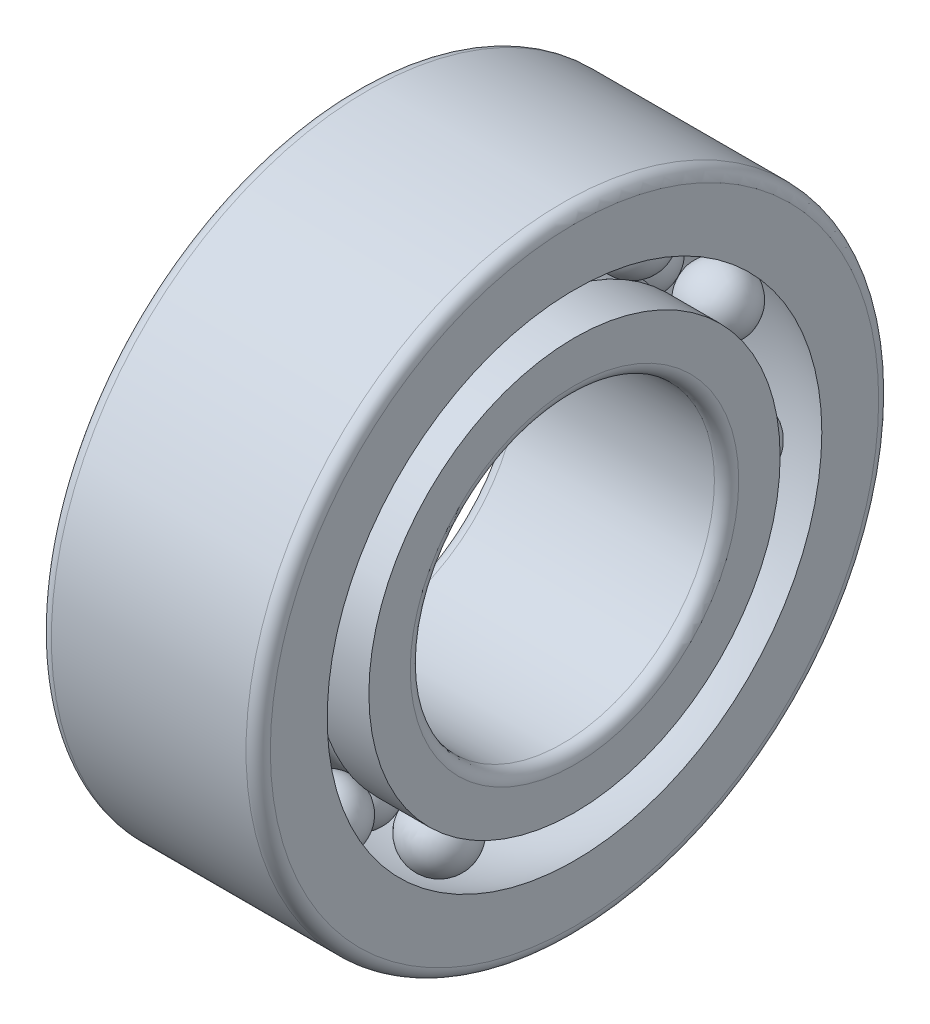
ISO-10303-21;
HEADER;
FILE_DESCRIPTION(('STEP AP214'),'2;1');
FILE_NAME('part.step','',(''),(''),'','','');
FILE_SCHEMA(('AUTOMOTIVE_DESIGN { 1 0 10303 214 1 1 1 1 }'));
ENDSEC;
DATA;
#1=APPLICATION_CONTEXT('core data for automotive mechanical design processes');
#2=APPLICATION_PROTOCOL_DEFINITION('international standard','automotive_design',2000,#1);
#3=PRODUCT_CONTEXT('',#1,'mechanical');
#4=PRODUCT('Part','Part','',(#3));
#5=PRODUCT_RELATED_PRODUCT_CATEGORY('part','',(#4));
#6=PRODUCT_DEFINITION_FORMATION('','',#4);
#7=PRODUCT_DEFINITION_CONTEXT('part definition',#1,'design');
#8=PRODUCT_DEFINITION('design','',#6,#7);
#9=PRODUCT_DEFINITION_SHAPE('','',#8);
#10=(LENGTH_UNIT() NAMED_UNIT(*) SI_UNIT(.MILLI.,.METRE.));
#11=(NAMED_UNIT(*) PLANE_ANGLE_UNIT() SI_UNIT($,.RADIAN.));
#12=(NAMED_UNIT(*) SI_UNIT($,.STERADIAN.) SOLID_ANGLE_UNIT());
#13=UNCERTAINTY_MEASURE_WITH_UNIT(LENGTH_MEASURE(1.E-05),#10,'distance_accuracy_value','');
#14=(GEOMETRIC_REPRESENTATION_CONTEXT(3) GLOBAL_UNCERTAINTY_ASSIGNED_CONTEXT((#13)) GLOBAL_UNIT_ASSIGNED_CONTEXT((#10,
#11,#12)) REPRESENTATION_CONTEXT('',''));
#15=CARTESIAN_POINT('',(0.,0.,0.));
#16=DIRECTION('',(0.,0.,1.));
#17=DIRECTION('',(1.,0.,0.));
#18=AXIS2_PLACEMENT_3D('',#15,#16,#17);
#19=CARTESIAN_POINT('',(5.7,-2.73956063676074,-19.054062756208));
#20=DIRECTION('',(1.,0.,0.));
#21=DIRECTION('',(0.,-0.989821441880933,0.142314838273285));
#22=AXIS2_PLACEMENT_3D('',#19,#20,#21);
#23=SPHERICAL_SURFACE('',#22,2.7);
#24=CARTESIAN_POINT('',(3.,-2.73956063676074,-19.054062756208));
#25=VERTEX_POINT('',#24);
#26=VERTEX_LOOP('',#25);
#27=FACE_BOUND('',#26,.T.);
#28=CARTESIAN_POINT('',(8.4,-2.73956063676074,-19.054062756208));
#29=VERTEX_POINT('',#28);
#30=VERTEX_LOOP('',#29);
#31=FACE_BOUND('',#30,.T.);
#32=ADVANCED_FACE('P0_F15',(#27,#31),#23,.T.);
#33=CLOSED_SHELL('',(#32));
#34=MANIFOLD_SOLID_BREP('P0_B1',#33);
#35=CARTESIAN_POINT('',(12.3,16.1941305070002,10.4073357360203));
#36=DIRECTION('',(1.,0.,0.));
#37=DIRECTION('',(0.,0.540640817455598,-0.841253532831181));
#38=AXIS2_PLACEMENT_3D('',#35,#36,#37);
#39=SPHERICAL_SURFACE('',#38,2.7);
#40=CARTESIAN_POINT('',(9.6,16.1941305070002,10.4073357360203));
#41=VERTEX_POINT('',#40);
#42=VERTEX_LOOP('',#41);
#43=FACE_BOUND('',#42,.T.);
#44=CARTESIAN_POINT('',(15.,16.1941305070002,10.4073357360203));
#45=VERTEX_POINT('',#44);
#46=VERTEX_LOOP('',#45);
#47=FACE_BOUND('',#46,.T.);
#48=ADVANCED_FACE('P1_F15',(#43,#47),#39,.T.);
#49=CLOSED_SHELL('',(#48));
#50=MANIFOLD_SOLID_BREP('P1_B1',#49);
#51=CARTESIAN_POINT('',(9.98438017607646,0.,0.));
#52=DIRECTION('',(1.,0.,0.));
#53=DIRECTION('',(0.,0.,-1.));
#54=AXIS2_PLACEMENT_3D('',#51,#52,#53);
#55=CYLINDRICAL_SURFACE('',#54,16.901);
#56=CARTESIAN_POINT('',(10.9687603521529,0.,0.));
#57=DIRECTION('',(1.,0.,0.));
#58=DIRECTION('',(0.,0.,-1.));
#59=AXIS2_PLACEMENT_3D('',#56,#57,#58);
#60=CIRCLE('',#59,16.901);
#61=CARTESIAN_POINT('',(10.9687603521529,0.,-16.901));
#62=VERTEX_POINT('',#61);
#63=EDGE_CURVE('P2_E123',#62,#62,#60,.T.);
#64=ORIENTED_EDGE('',*,*,#63,.F.);
#65=EDGE_LOOP('',(#64));
#66=FACE_BOUND('',#65,.T.);
#67=CARTESIAN_POINT('',(7.03123964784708,0.,0.));
#68=DIRECTION('',(-1.,0.,0.));
#69=DIRECTION('',(0.,0.,1.));
#70=AXIS2_PLACEMENT_3D('',#67,#68,#69);
#71=CIRCLE('',#70,16.901);
#72=CARTESIAN_POINT('',(7.03123964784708,0.,16.901));
#73=VERTEX_POINT('',#72);
#74=EDGE_CURVE('P2_E121',#73,#73,#71,.T.);
#75=ORIENTED_EDGE('',*,*,#74,.F.);
#76=EDGE_LOOP('',(#75));
#77=FACE_BOUND('',#76,.T.);
#78=ADVANCED_FACE('P2_F14',(#66,#77),#55,.T.);
#79=CARTESIAN_POINT('',(5.7,0.,0.));
#80=DIRECTION('',(1.,0.,0.));
#81=DIRECTION('',(0.,0.,-1.));
#82=AXIS2_PLACEMENT_3D('',#79,#80,#81);
#83=TOROIDAL_SURFACE('',#82,19.25,2.7);
#84=ORIENTED_EDGE('',*,*,#74,.T.);
#85=EDGE_LOOP('',(#84));
#86=FACE_BOUND('',#85,.T.);
#87=CARTESIAN_POINT('',(4.36876035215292,0.,0.));
#88=DIRECTION('',(1.,0.,0.));
#89=DIRECTION('',(0.,0.,-1.));
#90=AXIS2_PLACEMENT_3D('',#87,#88,#89);
#91=CIRCLE('',#90,16.901);
#92=CARTESIAN_POINT('',(4.36876035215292,0.,-16.901));
#93=VERTEX_POINT('',#92);
#94=EDGE_CURVE('P2_E126',#93,#93,#91,.F.);
#95=ORIENTED_EDGE('',*,*,#94,.F.);
#96=EDGE_LOOP('',(#95));
#97=FACE_BOUND('',#96,.T.);
#98=ADVANCED_FACE('P2_F90',(#86,#97),#83,.F.);
#99=CARTESIAN_POINT('',(12.3,0.,0.));
#100=DIRECTION('',(1.,0.,0.));
#101=DIRECTION('',(0.,1.,0.));
#102=AXIS2_PLACEMENT_3D('',#99,#100,#101);
#103=TOROIDAL_SURFACE('',#102,19.25,2.69999999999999);
#104=ORIENTED_EDGE('',*,*,#63,.T.);
#105=EDGE_LOOP('',(#104));
#106=FACE_BOUND('',#105,.T.);
#107=CARTESIAN_POINT('',(13.6312396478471,0.,0.));
#108=DIRECTION('',(1.,0.,0.));
#109=DIRECTION('',(0.,0.,-1.));
#110=AXIS2_PLACEMENT_3D('',#107,#108,#109);
#111=CIRCLE('',#110,16.901);
#112=CARTESIAN_POINT('',(13.6312396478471,0.,-16.901));
#113=VERTEX_POINT('',#112);
#114=EDGE_CURVE('P2_E119',#113,#113,#111,.T.);
#115=ORIENTED_EDGE('',*,*,#114,.F.);
#116=EDGE_LOOP('',(#115));
#117=FACE_BOUND('',#116,.T.);
#118=ADVANCED_FACE('P2_F16',(#106,#117),#103,.F.);
#119=CARTESIAN_POINT('',(2.18438017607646,0.,0.));
#120=DIRECTION('',(1.,0.,0.));
#121=DIRECTION('',(0.,0.,-1.));
#122=AXIS2_PLACEMENT_3D('',#119,#120,#121);
#123=CYLINDRICAL_SURFACE('',#122,16.901);
#124=CARTESIAN_POINT('',(0.,0.,0.));
#125=DIRECTION('',(1.,0.,0.));
#126=DIRECTION('',(0.,0.,-1.));
#127=AXIS2_PLACEMENT_3D('',#124,#125,#126);
#128=CIRCLE('',#127,16.901);
#129=CARTESIAN_POINT('',(0.,0.,-16.901));
#130=VERTEX_POINT('',#129);
#131=EDGE_CURVE('P2_E18',#130,#130,#128,.F.);
#132=ORIENTED_EDGE('',*,*,#131,.F.);
#133=EDGE_LOOP('',(#132));
#134=FACE_BOUND('',#133,.T.);
#135=ORIENTED_EDGE('',*,*,#94,.T.);
#136=EDGE_LOOP('',(#135));
#137=FACE_BOUND('',#136,.T.);
#138=ADVANCED_FACE('P2_F84',(#134,#137),#123,.T.);
#139=CARTESIAN_POINT('',(15.8156198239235,0.,0.));
#140=DIRECTION('',(1.,0.,0.));
#141=DIRECTION('',(0.,0.,-1.));
#142=AXIS2_PLACEMENT_3D('',#139,#140,#141);
#143=CYLINDRICAL_SURFACE('',#142,16.901);
#144=ORIENTED_EDGE('',*,*,#114,.T.);
#145=EDGE_LOOP('',(#144));
#146=FACE_BOUND('',#145,.T.);
#147=CARTESIAN_POINT('',(18.,0.,0.));
#148=DIRECTION('',(1.,0.,0.));
#149=DIRECTION('',(0.,0.,-1.));
#150=AXIS2_PLACEMENT_3D('',#147,#148,#149);
#151=CIRCLE('',#150,16.901);
#152=CARTESIAN_POINT('',(18.,0.,-16.901));
#153=VERTEX_POINT('',#152);
#154=EDGE_CURVE('P2_E114',#153,#153,#151,.T.);
#155=ORIENTED_EDGE('',*,*,#154,.F.);
#156=EDGE_LOOP('',(#155));
#157=FACE_BOUND('',#156,.T.);
#158=ADVANCED_FACE('P2_F80',(#146,#157),#143,.T.);
#159=CARTESIAN_POINT('',(0.,14.7005,0.));
#160=DIRECTION('',(-1.,0.,0.));
#161=DIRECTION('',(0.,0.,1.));
#162=AXIS2_PLACEMENT_3D('',#159,#160,#161);
#163=PLANE('',#162);
#164=CARTESIAN_POINT('',(0.,0.,0.));
#165=DIRECTION('',(-1.,0.,0.));
#166=DIRECTION('',(0.,1.,0.));
#167=AXIS2_PLACEMENT_3D('',#164,#165,#166);
#168=CIRCLE('',#167,13.5);
#169=CARTESIAN_POINT('',(0.,13.5,0.));
#170=VERTEX_POINT('',#169);
#171=EDGE_CURVE('P2_E64',#170,#170,#168,.T.);
#172=ORIENTED_EDGE('',*,*,#171,.F.);
#173=EDGE_LOOP('',(#172));
#174=FACE_BOUND('',#173,.T.);
#175=ORIENTED_EDGE('',*,*,#131,.T.);
#176=EDGE_LOOP('',(#175));
#177=FACE_BOUND('',#176,.T.);
#178=ADVANCED_FACE('P2_F70',(#174,#177),#163,.T.);
#179=CARTESIAN_POINT('',(18.,14.7005,0.));
#180=DIRECTION('',(1.,0.,0.));
#181=DIRECTION('',(0.,0.,-1.));
#182=AXIS2_PLACEMENT_3D('',#179,#180,#181);
#183=PLANE('',#182);
#184=CARTESIAN_POINT('',(18.,0.,0.));
#185=DIRECTION('',(1.,0.,0.));
#186=DIRECTION('',(0.,1.,0.));
#187=AXIS2_PLACEMENT_3D('',#184,#185,#186);
#188=CIRCLE('',#187,13.5);
#189=CARTESIAN_POINT('',(18.,13.5,0.));
#190=VERTEX_POINT('',#189);
#191=EDGE_CURVE('P2_E27',#190,#190,#188,.T.);
#192=ORIENTED_EDGE('',*,*,#191,.F.);
#193=EDGE_LOOP('',(#192));
#194=FACE_BOUND('',#193,.T.);
#195=ORIENTED_EDGE('',*,*,#154,.T.);
#196=EDGE_LOOP('',(#195));
#197=FACE_BOUND('',#196,.T.);
#198=ADVANCED_FACE('P2_F79',(#194,#197),#183,.T.);
#199=CARTESIAN_POINT('',(1.,0.,0.));
#200=DIRECTION('',(1.,0.,0.));
#201=DIRECTION('',(0.,0.,-1.));
#202=AXIS2_PLACEMENT_3D('',#199,#200,#201);
#203=TOROIDAL_SURFACE('',#202,13.5,1.);
#204=ORIENTED_EDGE('',*,*,#171,.T.);
#205=EDGE_LOOP('',(#204));
#206=FACE_BOUND('',#205,.T.);
#207=CARTESIAN_POINT('',(1.,0.,0.));
#208=DIRECTION('',(1.,0.,0.));
#209=DIRECTION('',(0.,0.,-1.));
#210=AXIS2_PLACEMENT_3D('',#207,#208,#209);
#211=CIRCLE('',#210,12.5);
#212=CARTESIAN_POINT('',(1.,0.,-12.5));
#213=VERTEX_POINT('',#212);
#214=EDGE_CURVE('P2_E22',#213,#213,#211,.T.);
#215=ORIENTED_EDGE('',*,*,#214,.T.);
#216=EDGE_LOOP('',(#215));
#217=FACE_BOUND('',#216,.T.);
#218=ADVANCED_FACE('P2_F45',(#206,#217),#203,.T.);
#219=CARTESIAN_POINT('',(17.,0.,0.));
#220=DIRECTION('',(1.,0.,0.));
#221=DIRECTION('',(0.,0.,-1.));
#222=AXIS2_PLACEMENT_3D('',#219,#220,#221);
#223=TOROIDAL_SURFACE('',#222,13.5,1.);
#224=CARTESIAN_POINT('',(17.,0.,0.));
#225=DIRECTION('',(1.,0.,0.));
#226=DIRECTION('',(0.,0.,-1.));
#227=AXIS2_PLACEMENT_3D('',#224,#225,#226);
#228=CIRCLE('',#227,12.5);
#229=CARTESIAN_POINT('',(17.,0.,-12.5));
#230=VERTEX_POINT('',#229);
#231=EDGE_CURVE('P2_E10',#230,#230,#228,.F.);
#232=ORIENTED_EDGE('',*,*,#231,.T.);
#233=EDGE_LOOP('',(#232));
#234=FACE_BOUND('',#233,.T.);
#235=ORIENTED_EDGE('',*,*,#191,.T.);
#236=EDGE_LOOP('',(#235));
#237=FACE_BOUND('',#236,.T.);
#238=ADVANCED_FACE('P2_F39',(#234,#237),#223,.T.);
#239=CARTESIAN_POINT('',(13.5,0.,0.));
#240=DIRECTION('',(1.,0.,0.));
#241=DIRECTION('',(0.,0.,-1.));
#242=AXIS2_PLACEMENT_3D('',#239,#240,#241);
#243=CYLINDRICAL_SURFACE('',#242,12.5);
#244=ORIENTED_EDGE('',*,*,#231,.F.);
#245=EDGE_LOOP('',(#244));
#246=FACE_BOUND('',#245,.T.);
#247=ORIENTED_EDGE('',*,*,#214,.F.);
#248=EDGE_LOOP('',(#247));
#249=FACE_BOUND('',#248,.T.);
#250=ADVANCED_FACE('P2_F44',(#246,#249),#243,.F.);
#251=CLOSED_SHELL('',(#78,#98,#118,#138,#158,#178,#198,#218,#238,#250));
#252=MANIFOLD_SOLID_BREP('P2_B1',#251);
#253=CARTESIAN_POINT('',(12.3,-2.73956063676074,19.054062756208));
#254=DIRECTION('',(1.,0.,0.));
#255=DIRECTION('',(0.,0.989821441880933,0.142314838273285));
#256=AXIS2_PLACEMENT_3D('',#253,#254,#255);
#257=SPHERICAL_SURFACE('',#256,2.7);
#258=CARTESIAN_POINT('',(9.6,-2.73956063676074,19.054062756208));
#259=VERTEX_POINT('',#258);
#260=VERTEX_LOOP('',#259);
#261=FACE_BOUND('',#260,.T.);
#262=CARTESIAN_POINT('',(15.,-2.73956063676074,19.054062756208));
#263=VERTEX_POINT('',#262);
#264=VERTEX_LOOP('',#263);
#265=FACE_BOUND('',#264,.T.);
#266=ADVANCED_FACE('P3_F15',(#261,#265),#257,.T.);
#267=CLOSED_SHELL('',(#266));
#268=MANIFOLD_SOLID_BREP('P3_B1',#267);
#269=CARTESIAN_POINT('',(9.,0.,0.));
#270=DIRECTION('',(0.,0.,1.));
#271=DIRECTION('',(1.,0.,0.));
#272=AXIS2_PLACEMENT_3D('',#269,#270,#271);
#273=SPHERICAL_SURFACE('',#272,22.2308089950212);
#274=CARTESIAN_POINT('',(9.,0.,0.));
#275=DIRECTION('',(1.,0.,0.));
#276=DIRECTION('',(0.,0.,-1.));
#277=AXIS2_PLACEMENT_3D('',#274,#275,#276);
#278=SPHERICAL_SURFACE('',#277,22.2308089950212);
#279=CARTESIAN_POINT('',(18.,0.,0.));
#280=DIRECTION('',(1.,0.,0.));
#281=DIRECTION('',(0.,0.,-1.));
#282=AXIS2_PLACEMENT_3D('',#279,#280,#281);
#283=CIRCLE('',#282,20.3275396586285);
#284=CARTESIAN_POINT('',(18.,0.,-20.3275396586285));
#285=VERTEX_POINT('',#284);
#286=EDGE_CURVE('P4_E91',#285,#285,#283,.F.);
#287=ORIENTED_EDGE('',*,*,#286,.F.);
#288=EDGE_LOOP('',(#287));
#289=FACE_BOUND('',#288,.T.);
#290=CARTESIAN_POINT('',(0.,0.,0.));
#291=DIRECTION('',(-1.,0.,0.));
#292=DIRECTION('',(0.,0.,1.));
#293=AXIS2_PLACEMENT_3D('',#290,#291,#292);
#294=CIRCLE('',#293,20.3275396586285);
#295=CARTESIAN_POINT('',(0.,0.,20.3275396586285));
#296=VERTEX_POINT('',#295);
#297=EDGE_CURVE('P4_E17',#296,#296,#294,.F.);
#298=ORIENTED_EDGE('',*,*,#297,.F.);
#299=EDGE_LOOP('',(#298));
#300=FACE_BOUND('',#299,.T.);
#301=ADVANCED_FACE('P4_F14',(#289,#300),#278,.F.);
#302=CARTESIAN_POINT('',(0.,23.1637698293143,0.));
#303=DIRECTION('',(-1.,0.,0.));
#304=DIRECTION('',(0.,0.,1.));
#305=AXIS2_PLACEMENT_3D('',#302,#303,#304);
#306=PLANE('',#305);
#307=ORIENTED_EDGE('',*,*,#297,.T.);
#308=EDGE_LOOP('',(#307));
#309=FACE_BOUND('',#308,.T.);
#310=CARTESIAN_POINT('',(0.,0.,0.));
#311=DIRECTION('',(1.,0.,0.));
#312=DIRECTION('',(0.,1.,0.));
#313=AXIS2_PLACEMENT_3D('',#310,#311,#312);
#314=CIRCLE('',#313,25.);
#315=CARTESIAN_POINT('',(0.,25.,0.));
#316=VERTEX_POINT('',#315);
#317=EDGE_CURVE('P4_E64',#316,#316,#314,.T.);
#318=ORIENTED_EDGE('',*,*,#317,.F.);
#319=EDGE_LOOP('',(#318));
#320=FACE_BOUND('',#319,.T.);
#321=ADVANCED_FACE('P4_F69',(#309,#320),#306,.T.);
#322=CARTESIAN_POINT('',(18.,23.1637698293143,0.));
#323=DIRECTION('',(1.,0.,0.));
#324=DIRECTION('',(0.,0.,-1.));
#325=AXIS2_PLACEMENT_3D('',#322,#323,#324);
#326=PLANE('',#325);
#327=ORIENTED_EDGE('',*,*,#286,.T.);
#328=EDGE_LOOP('',(#327));
#329=FACE_BOUND('',#328,.T.);
#330=CARTESIAN_POINT('',(18.,0.,0.));
#331=DIRECTION('',(-1.,0.,0.));
#332=DIRECTION('',(0.,1.,0.));
#333=AXIS2_PLACEMENT_3D('',#330,#331,#332);
#334=CIRCLE('',#333,25.);
#335=CARTESIAN_POINT('',(18.,25.,0.));
#336=VERTEX_POINT('',#335);
#337=EDGE_CURVE('P4_E26',#336,#336,#334,.T.);
#338=ORIENTED_EDGE('',*,*,#337,.F.);
#339=EDGE_LOOP('',(#338));
#340=FACE_BOUND('',#339,.T.);
#341=ADVANCED_FACE('P4_F77',(#329,#340),#326,.T.);
#342=CARTESIAN_POINT('',(0.999999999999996,0.,0.));
#343=DIRECTION('',(1.,0.,0.));
#344=DIRECTION('',(0.,0.,-1.));
#345=AXIS2_PLACEMENT_3D('',#342,#343,#344);
#346=TOROIDAL_SURFACE('',#345,25.,1.);
#347=CARTESIAN_POINT('',(0.999999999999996,0.,0.));
#348=DIRECTION('',(1.,0.,0.));
#349=DIRECTION('',(0.,0.,-1.));
#350=AXIS2_PLACEMENT_3D('',#347,#348,#349);
#351=CIRCLE('',#350,26.);
#352=CARTESIAN_POINT('',(0.999999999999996,0.,-26.));
#353=VERTEX_POINT('',#352);
#354=EDGE_CURVE('P4_E21',#353,#353,#351,.T.);
#355=ORIENTED_EDGE('',*,*,#354,.F.);
#356=EDGE_LOOP('',(#355));
#357=FACE_BOUND('',#356,.T.);
#358=ORIENTED_EDGE('',*,*,#317,.T.);
#359=EDGE_LOOP('',(#358));
#360=FACE_BOUND('',#359,.T.);
#361=ADVANCED_FACE('P4_F44',(#357,#360),#346,.T.);
#362=CARTESIAN_POINT('',(17.,0.,0.));
#363=DIRECTION('',(1.,0.,0.));
#364=DIRECTION('',(0.,0.,-1.));
#365=AXIS2_PLACEMENT_3D('',#362,#363,#364);
#366=TOROIDAL_SURFACE('',#365,25.,1.);
#367=ORIENTED_EDGE('',*,*,#337,.T.);
#368=EDGE_LOOP('',(#367));
#369=FACE_BOUND('',#368,.T.);
#370=CARTESIAN_POINT('',(17.,0.,0.));
#371=DIRECTION('',(1.,0.,0.));
#372=DIRECTION('',(0.,0.,-1.));
#373=AXIS2_PLACEMENT_3D('',#370,#371,#372);
#374=CIRCLE('',#373,26.);
#375=CARTESIAN_POINT('',(17.,0.,-26.));
#376=VERTEX_POINT('',#375);
#377=EDGE_CURVE('P4_E10',#376,#376,#374,.F.);
#378=ORIENTED_EDGE('',*,*,#377,.F.);
#379=EDGE_LOOP('',(#378));
#380=FACE_BOUND('',#379,.T.);
#381=ADVANCED_FACE('P4_F38',(#369,#380),#366,.T.);
#382=CARTESIAN_POINT('',(13.5,0.,0.));
#383=DIRECTION('',(1.,0.,0.));
#384=DIRECTION('',(0.,0.,-1.));
#385=AXIS2_PLACEMENT_3D('',#382,#383,#384);
#386=CYLINDRICAL_SURFACE('',#385,26.);
#387=ORIENTED_EDGE('',*,*,#377,.T.);
#388=EDGE_LOOP('',(#387));
#389=FACE_BOUND('',#388,.T.);
#390=ORIENTED_EDGE('',*,*,#354,.T.);
#391=EDGE_LOOP('',(#390));
#392=FACE_BOUND('',#391,.T.);
#393=ADVANCED_FACE('P4_F43',(#389,#392),#386,.T.);
#394=CLOSED_SHELL('',(#301,#321,#341,#361,#381,#393));
#395=MANIFOLD_SOLID_BREP('P4_B1',#394);
#396=CARTESIAN_POINT('',(5.7,19.25,0.));
#397=DIRECTION('',(1.,0.,0.));
#398=DIRECTION('',(0.,0.,-1.));
#399=AXIS2_PLACEMENT_3D('',#396,#397,#398);
#400=SPHERICAL_SURFACE('',#399,2.7);
#401=CARTESIAN_POINT('',(3.,19.25,0.));
#402=VERTEX_POINT('',#401);
#403=VERTEX_LOOP('',#402);
#404=FACE_BOUND('',#403,.T.);
#405=CARTESIAN_POINT('',(8.4,19.25,0.));
#406=VERTEX_POINT('',#405);
#407=VERTEX_LOOP('',#406);
#408=FACE_BOUND('',#407,.T.);
#409=ADVANCED_FACE('P5_F15',(#404,#408),#400,.T.);
#410=CLOSED_SHELL('',(#409));
#411=MANIFOLD_SOLID_BREP('P5_B1',#410);
#412=CARTESIAN_POINT('',(12.3,-18.4702397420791,5.42335171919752));
#413=DIRECTION('',(1.,0.,0.));
#414=DIRECTION('',(0.,0.28173255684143,0.959492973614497));
#415=AXIS2_PLACEMENT_3D('',#412,#413,#414);
#416=SPHERICAL_SURFACE('',#415,2.7);
#417=CARTESIAN_POINT('',(9.6,-18.4702397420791,5.42335171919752));
#418=VERTEX_POINT('',#417);
#419=VERTEX_LOOP('',#418);
#420=FACE_BOUND('',#419,.T.);
#421=CARTESIAN_POINT('',(15.,-18.4702397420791,5.42335171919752));
#422=VERTEX_POINT('',#421);
#423=VERTEX_LOOP('',#422);
#424=FACE_BOUND('',#423,.T.);
#425=ADVANCED_FACE('P6_F15',(#420,#424),#416,.T.);
#426=CLOSED_SHELL('',(#425));
#427=MANIFOLD_SOLID_BREP('P6_B1',#426);
#428=CARTESIAN_POINT('',(5.7,-2.73956063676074,19.054062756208));
#429=DIRECTION('',(1.,0.,0.));
#430=DIRECTION('',(0.,0.989821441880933,0.142314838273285));
#431=AXIS2_PLACEMENT_3D('',#428,#429,#430);
#432=SPHERICAL_SURFACE('',#431,2.7);
#433=CARTESIAN_POINT('',(3.,-2.73956063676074,19.054062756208));
#434=VERTEX_POINT('',#433);
#435=VERTEX_LOOP('',#434);
#436=FACE_BOUND('',#435,.T.);
#437=CARTESIAN_POINT('',(8.4,-2.73956063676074,19.054062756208));
#438=VERTEX_POINT('',#437);
#439=VERTEX_LOOP('',#438);
#440=FACE_BOUND('',#439,.T.);
#441=ADVANCED_FACE('P7_F15',(#436,#440),#432,.T.);
#442=CLOSED_SHELL('',(#441));
#443=MANIFOLD_SOLID_BREP('P7_B1',#442);
#444=CARTESIAN_POINT('',(12.3,19.25,0.));
#445=DIRECTION('',(1.,0.,0.));
#446=DIRECTION('',(0.,0.,-1.));
#447=AXIS2_PLACEMENT_3D('',#444,#445,#446);
#448=SPHERICAL_SURFACE('',#447,2.7);
#449=CARTESIAN_POINT('',(9.6,19.25,0.));
#450=VERTEX_POINT('',#449);
#451=VERTEX_LOOP('',#450);
#452=FACE_BOUND('',#451,.T.);
#453=CARTESIAN_POINT('',(15.,19.25,0.));
#454=VERTEX_POINT('',#453);
#455=VERTEX_LOOP('',#454);
#456=FACE_BOUND('',#455,.T.);
#457=ADVANCED_FACE('P8_F15',(#452,#456),#448,.T.);
#458=CLOSED_SHELL('',(#457));
#459=MANIFOLD_SOLID_BREP('P8_B1',#458);
#460=CARTESIAN_POINT('',(12.3,-12.6060691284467,-14.5481793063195));
#461=DIRECTION('',(1.,0.,0.));
#462=DIRECTION('',(0.,-0.755749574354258,0.654860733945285));
#463=AXIS2_PLACEMENT_3D('',#460,#461,#462);
#464=SPHERICAL_SURFACE('',#463,2.7);
#465=CARTESIAN_POINT('',(9.6,-12.6060691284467,-14.5481793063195));
#466=VERTEX_POINT('',#465);
#467=VERTEX_LOOP('',#466);
#468=FACE_BOUND('',#467,.T.);
#469=CARTESIAN_POINT('',(15.,-12.6060691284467,-14.5481793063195));
#470=VERTEX_POINT('',#469);
#471=VERTEX_LOOP('',#470);
#472=FACE_BOUND('',#471,.T.);
#473=ADVANCED_FACE('P9_F15',(#468,#472),#464,.T.);
#474=CLOSED_SHELL('',(#473));
#475=MANIFOLD_SOLID_BREP('P9_B1',#474);
#476=CARTESIAN_POINT('',(12.3,-18.4702397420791,-5.42335171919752));
#477=DIRECTION('',(1.,0.,0.));
#478=DIRECTION('',(0.,-0.28173255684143,0.959492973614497));
#479=AXIS2_PLACEMENT_3D('',#476,#477,#478);
#480=SPHERICAL_SURFACE('',#479,2.7);
#481=CARTESIAN_POINT('',(9.6,-18.4702397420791,-5.42335171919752));
#482=VERTEX_POINT('',#481);
#483=VERTEX_LOOP('',#482);
#484=FACE_BOUND('',#483,.T.);
#485=CARTESIAN_POINT('',(15.,-18.4702397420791,-5.42335171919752));
#486=VERTEX_POINT('',#485);
#487=VERTEX_LOOP('',#486);
#488=FACE_BOUND('',#487,.T.);
#489=ADVANCED_FACE('P10_F15',(#484,#488),#480,.T.);
#490=CLOSED_SHELL('',(#489));
#491=MANIFOLD_SOLID_BREP('P10_B1',#490);
#492=CARTESIAN_POINT('',(12.3,7.99673900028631,17.5104159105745));
#493=DIRECTION('',(1.,0.,0.));
#494=DIRECTION('',(0.,0.909631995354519,-0.415415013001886));
#495=AXIS2_PLACEMENT_3D('',#492,#493,#494);
#496=SPHERICAL_SURFACE('',#495,2.7);
#497=CARTESIAN_POINT('',(9.6,7.99673900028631,17.5104159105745));
#498=VERTEX_POINT('',#497);
#499=VERTEX_LOOP('',#498);
#500=FACE_BOUND('',#499,.T.);
#501=CARTESIAN_POINT('',(15.,7.99673900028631,17.5104159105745));
#502=VERTEX_POINT('',#501);
#503=VERTEX_LOOP('',#502);
#504=FACE_BOUND('',#503,.T.);
#505=ADVANCED_FACE('P11_F15',(#500,#504),#496,.T.);
#506=CLOSED_SHELL('',(#505));
#507=MANIFOLD_SOLID_BREP('P11_B1',#506);
#508=CARTESIAN_POINT('',(5.7,-18.4702397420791,5.42335171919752));
#509=DIRECTION('',(1.,0.,0.));
#510=DIRECTION('',(0.,0.28173255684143,0.959492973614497));
#511=AXIS2_PLACEMENT_3D('',#508,#509,#510);
#512=SPHERICAL_SURFACE('',#511,2.7);
#513=CARTESIAN_POINT('',(3.,-18.4702397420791,5.42335171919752));
#514=VERTEX_POINT('',#513);
#515=VERTEX_LOOP('',#514);
#516=FACE_BOUND('',#515,.T.);
#517=CARTESIAN_POINT('',(8.4,-18.4702397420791,5.42335171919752));
#518=VERTEX_POINT('',#517);
#519=VERTEX_LOOP('',#518);
#520=FACE_BOUND('',#519,.T.);
#521=ADVANCED_FACE('P12_F15',(#516,#520),#512,.T.);
#522=CLOSED_SHELL('',(#521));
#523=MANIFOLD_SOLID_BREP('P12_B1',#522);
#524=CARTESIAN_POINT('',(12.3,16.1941305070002,-10.4073357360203));
#525=DIRECTION('',(1.,0.,0.));
#526=DIRECTION('',(0.,-0.540640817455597,-0.841253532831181));
#527=AXIS2_PLACEMENT_3D('',#524,#525,#526);
#528=SPHERICAL_SURFACE('',#527,2.7);
#529=CARTESIAN_POINT('',(9.6,16.1941305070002,-10.4073357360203));
#530=VERTEX_POINT('',#529);
#531=VERTEX_LOOP('',#530);
#532=FACE_BOUND('',#531,.T.);
#533=CARTESIAN_POINT('',(15.,16.1941305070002,-10.4073357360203));
#534=VERTEX_POINT('',#533);
#535=VERTEX_LOOP('',#534);
#536=FACE_BOUND('',#535,.T.);
#537=ADVANCED_FACE('P13_F15',(#532,#536),#528,.T.);
#538=CLOSED_SHELL('',(#537));
#539=MANIFOLD_SOLID_BREP('P13_B1',#538);
#540=CARTESIAN_POINT('',(5.7,16.1941305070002,10.4073357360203));
#541=DIRECTION('',(1.,0.,0.));
#542=DIRECTION('',(0.,0.540640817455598,-0.841253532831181));
#543=AXIS2_PLACEMENT_3D('',#540,#541,#542);
#544=SPHERICAL_SURFACE('',#543,2.7);
#545=CARTESIAN_POINT('',(3.,16.1941305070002,10.4073357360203));
#546=VERTEX_POINT('',#545);
#547=VERTEX_LOOP('',#546);
#548=FACE_BOUND('',#547,.T.);
#549=CARTESIAN_POINT('',(8.4,16.1941305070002,10.4073357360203));
#550=VERTEX_POINT('',#549);
#551=VERTEX_LOOP('',#550);
#552=FACE_BOUND('',#551,.T.);
#553=ADVANCED_FACE('P14_F15',(#548,#552),#544,.T.);
#554=CLOSED_SHELL('',(#553));
#555=MANIFOLD_SOLID_BREP('P14_B1',#554);
#556=CARTESIAN_POINT('',(5.7,7.99673900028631,17.5104159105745));
#557=DIRECTION('',(1.,0.,0.));
#558=DIRECTION('',(0.,0.909631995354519,-0.415415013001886));
#559=AXIS2_PLACEMENT_3D('',#556,#557,#558);
#560=SPHERICAL_SURFACE('',#559,2.7);
#561=CARTESIAN_POINT('',(3.,7.99673900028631,17.5104159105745));
#562=VERTEX_POINT('',#561);
#563=VERTEX_LOOP('',#562);
#564=FACE_BOUND('',#563,.T.);
#565=CARTESIAN_POINT('',(8.4,7.99673900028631,17.5104159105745));
#566=VERTEX_POINT('',#565);
#567=VERTEX_LOOP('',#566);
#568=FACE_BOUND('',#567,.T.);
#569=ADVANCED_FACE('P15_F15',(#564,#568),#560,.T.);
#570=CLOSED_SHELL('',(#569));
#571=MANIFOLD_SOLID_BREP('P15_B1',#570);
#572=CARTESIAN_POINT('',(5.7,-18.4702397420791,-5.42335171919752));
#573=DIRECTION('',(1.,0.,0.));
#574=DIRECTION('',(0.,-0.28173255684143,0.959492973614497));
#575=AXIS2_PLACEMENT_3D('',#572,#573,#574);
#576=SPHERICAL_SURFACE('',#575,2.7);
#577=CARTESIAN_POINT('',(3.,-18.4702397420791,-5.42335171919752));
#578=VERTEX_POINT('',#577);
#579=VERTEX_LOOP('',#578);
#580=FACE_BOUND('',#579,.T.);
#581=CARTESIAN_POINT('',(8.4,-18.4702397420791,-5.42335171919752));
#582=VERTEX_POINT('',#581);
#583=VERTEX_LOOP('',#582);
#584=FACE_BOUND('',#583,.T.);
#585=ADVANCED_FACE('P16_F15',(#580,#584),#576,.T.);
#586=CLOSED_SHELL('',(#585));
#587=MANIFOLD_SOLID_BREP('P16_B1',#586);
#588=CARTESIAN_POINT('',(5.7,-12.6060691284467,14.5481793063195));
#589=DIRECTION('',(1.,0.,0.));
#590=DIRECTION('',(0.,0.755749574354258,0.654860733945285));
#591=AXIS2_PLACEMENT_3D('',#588,#589,#590);
#592=SPHERICAL_SURFACE('',#591,2.7);
#593=CARTESIAN_POINT('',(3.,-12.6060691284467,14.5481793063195));
#594=VERTEX_POINT('',#593);
#595=VERTEX_LOOP('',#594);
#596=FACE_BOUND('',#595,.T.);
#597=CARTESIAN_POINT('',(8.4,-12.6060691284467,14.5481793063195));
#598=VERTEX_POINT('',#597);
#599=VERTEX_LOOP('',#598);
#600=FACE_BOUND('',#599,.T.);
#601=ADVANCED_FACE('P17_F15',(#596,#600),#592,.T.);
#602=CLOSED_SHELL('',(#601));
#603=MANIFOLD_SOLID_BREP('P17_B1',#602);
#604=CARTESIAN_POINT('',(5.7,7.99673900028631,-17.5104159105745));
#605=DIRECTION('',(1.,0.,0.));
#606=DIRECTION('',(0.,-0.909631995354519,-0.415415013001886));
#607=AXIS2_PLACEMENT_3D('',#604,#605,#606);
#608=SPHERICAL_SURFACE('',#607,2.7);
#609=CARTESIAN_POINT('',(3.,7.99673900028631,-17.5104159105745));
#610=VERTEX_POINT('',#609);
#611=VERTEX_LOOP('',#610);
#612=FACE_BOUND('',#611,.T.);
#613=CARTESIAN_POINT('',(8.4,7.99673900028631,-17.5104159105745));
#614=VERTEX_POINT('',#613);
#615=VERTEX_LOOP('',#614);
#616=FACE_BOUND('',#615,.T.);
#617=ADVANCED_FACE('P18_F15',(#612,#616),#608,.T.);
#618=CLOSED_SHELL('',(#617));
#619=MANIFOLD_SOLID_BREP('P18_B1',#618);
#620=CARTESIAN_POINT('',(5.7,-12.6060691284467,-14.5481793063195));
#621=DIRECTION('',(1.,0.,0.));
#622=DIRECTION('',(0.,-0.755749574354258,0.654860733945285));
#623=AXIS2_PLACEMENT_3D('',#620,#621,#622);
#624=SPHERICAL_SURFACE('',#623,2.7);
#625=CARTESIAN_POINT('',(3.,-12.6060691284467,-14.5481793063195));
#626=VERTEX_POINT('',#625);
#627=VERTEX_LOOP('',#626);
#628=FACE_BOUND('',#627,.T.);
#629=CARTESIAN_POINT('',(8.4,-12.6060691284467,-14.5481793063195));
#630=VERTEX_POINT('',#629);
#631=VERTEX_LOOP('',#630);
#632=FACE_BOUND('',#631,.T.);
#633=ADVANCED_FACE('P19_F15',(#628,#632),#624,.T.);
#634=CLOSED_SHELL('',(#633));
#635=MANIFOLD_SOLID_BREP('P19_B1',#634);
#636=CARTESIAN_POINT('',(12.3,-2.73956063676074,-19.054062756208));
#637=DIRECTION('',(1.,0.,0.));
#638=DIRECTION('',(0.,-0.989821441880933,0.142314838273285));
#639=AXIS2_PLACEMENT_3D('',#636,#637,#638);
#640=SPHERICAL_SURFACE('',#639,2.7);
#641=CARTESIAN_POINT('',(9.6,-2.73956063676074,-19.054062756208));
#642=VERTEX_POINT('',#641);
#643=VERTEX_LOOP('',#642);
#644=FACE_BOUND('',#643,.T.);
#645=CARTESIAN_POINT('',(15.,-2.73956063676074,-19.054062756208));
#646=VERTEX_POINT('',#645);
#647=VERTEX_LOOP('',#646);
#648=FACE_BOUND('',#647,.T.);
#649=ADVANCED_FACE('P20_F15',(#644,#648),#640,.T.);
#650=CLOSED_SHELL('',(#649));
#651=MANIFOLD_SOLID_BREP('P20_B1',#650);
#652=CARTESIAN_POINT('',(5.7,16.1941305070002,-10.4073357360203));
#653=DIRECTION('',(1.,0.,0.));
#654=DIRECTION('',(0.,-0.540640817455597,-0.841253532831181));
#655=AXIS2_PLACEMENT_3D('',#652,#653,#654);
#656=SPHERICAL_SURFACE('',#655,2.7);
#657=CARTESIAN_POINT('',(3.,16.1941305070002,-10.4073357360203));
#658=VERTEX_POINT('',#657);
#659=VERTEX_LOOP('',#658);
#660=FACE_BOUND('',#659,.T.);
#661=CARTESIAN_POINT('',(8.4,16.1941305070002,-10.4073357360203));
#662=VERTEX_POINT('',#661);
#663=VERTEX_LOOP('',#662);
#664=FACE_BOUND('',#663,.T.);
#665=ADVANCED_FACE('P21_F15',(#660,#664),#656,.T.);
#666=CLOSED_SHELL('',(#665));
#667=MANIFOLD_SOLID_BREP('P21_B1',#666);
#668=CARTESIAN_POINT('',(12.3,7.99673900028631,-17.5104159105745));
#669=DIRECTION('',(1.,0.,0.));
#670=DIRECTION('',(0.,-0.909631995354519,-0.415415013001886));
#671=AXIS2_PLACEMENT_3D('',#668,#669,#670);
#672=SPHERICAL_SURFACE('',#671,2.7);
#673=CARTESIAN_POINT('',(9.6,7.99673900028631,-17.5104159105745));
#674=VERTEX_POINT('',#673);
#675=VERTEX_LOOP('',#674);
#676=FACE_BOUND('',#675,.T.);
#677=CARTESIAN_POINT('',(15.,7.99673900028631,-17.5104159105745));
#678=VERTEX_POINT('',#677);
#679=VERTEX_LOOP('',#678);
#680=FACE_BOUND('',#679,.T.);
#681=ADVANCED_FACE('P22_F15',(#676,#680),#672,.T.);
#682=CLOSED_SHELL('',(#681));
#683=MANIFOLD_SOLID_BREP('P22_B1',#682);
#684=CARTESIAN_POINT('',(12.3,-12.6060691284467,14.5481793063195));
#685=DIRECTION('',(1.,0.,0.));
#686=DIRECTION('',(0.,0.755749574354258,0.654860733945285));
#687=AXIS2_PLACEMENT_3D('',#684,#685,#686);
#688=SPHERICAL_SURFACE('',#687,2.7);
#689=CARTESIAN_POINT('',(9.6,-12.6060691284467,14.5481793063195));
#690=VERTEX_POINT('',#689);
#691=VERTEX_LOOP('',#690);
#692=FACE_BOUND('',#691,.T.);
#693=CARTESIAN_POINT('',(15.,-12.6060691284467,14.5481793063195));
#694=VERTEX_POINT('',#693);
#695=VERTEX_LOOP('',#694);
#696=FACE_BOUND('',#695,.T.);
#697=ADVANCED_FACE('P23_F15',(#692,#696),#688,.T.);
#698=CLOSED_SHELL('',(#697));
#699=MANIFOLD_SOLID_BREP('P23_B1',#698);
#700=ADVANCED_BREP_SHAPE_REPRESENTATION('',(#18,#34,#50,#252,#268,#395,#411,#427,#443,#459,#475,
#491,#507,#523,#539,#555,#571,#587,#603,#619,#635,#651,#667,#683,#699),#14);
#701=SHAPE_DEFINITION_REPRESENTATION(#9,#700);
ENDSEC;
END-ISO-10303-21;
